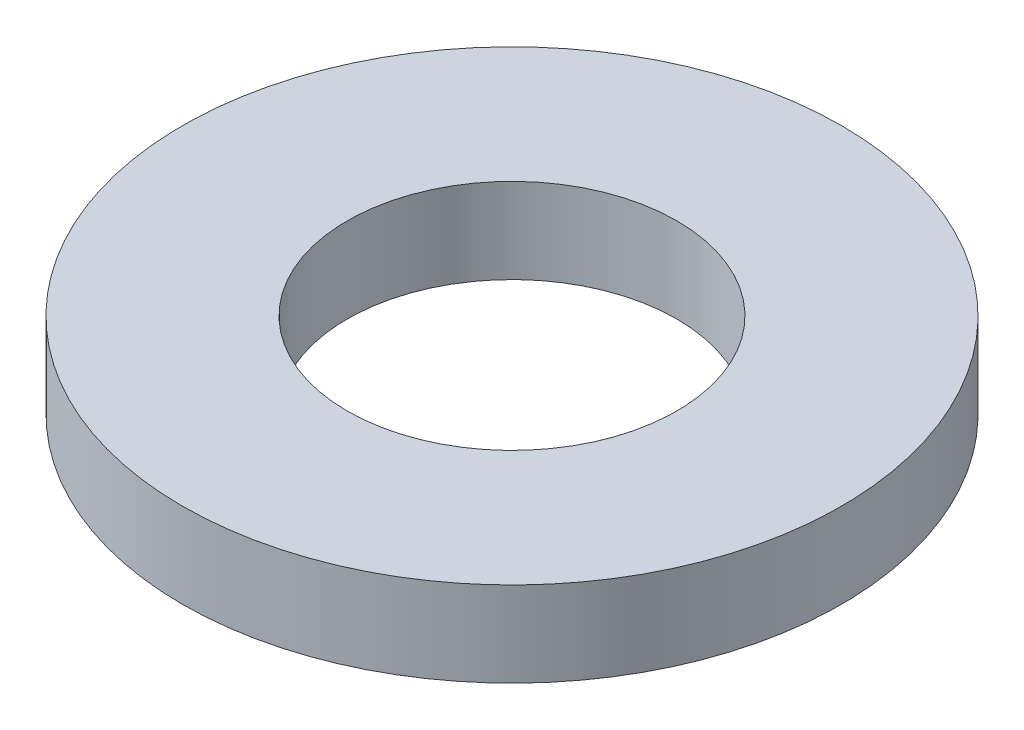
ISO-10303-21;
HEADER;
FILE_DESCRIPTION(('STEP AP214'),'2;1');
FILE_NAME('part.step','',(''),(''),'','','');
FILE_SCHEMA(('AUTOMOTIVE_DESIGN { 1 0 10303 214 1 1 1 1 }'));
ENDSEC;
DATA;
#1=APPLICATION_CONTEXT('core data for automotive mechanical design processes');
#2=APPLICATION_PROTOCOL_DEFINITION('international standard','automotive_design',2000,#1);
#3=PRODUCT_CONTEXT('',#1,'mechanical');
#4=PRODUCT('Part','Part','',(#3));
#5=PRODUCT_RELATED_PRODUCT_CATEGORY('part','',(#4));
#6=PRODUCT_DEFINITION_FORMATION('','',#4);
#7=PRODUCT_DEFINITION_CONTEXT('part definition',#1,'design');
#8=PRODUCT_DEFINITION('design','',#6,#7);
#9=PRODUCT_DEFINITION_SHAPE('','',#8);
#10=(LENGTH_UNIT() NAMED_UNIT(*) SI_UNIT(.MILLI.,.METRE.));
#11=(NAMED_UNIT(*) PLANE_ANGLE_UNIT() SI_UNIT($,.RADIAN.));
#12=(NAMED_UNIT(*) SI_UNIT($,.STERADIAN.) SOLID_ANGLE_UNIT());
#13=UNCERTAINTY_MEASURE_WITH_UNIT(LENGTH_MEASURE(1.E-05),#10,'distance_accuracy_value','');
#14=(GEOMETRIC_REPRESENTATION_CONTEXT(3) GLOBAL_UNCERTAINTY_ASSIGNED_CONTEXT((#13)) GLOBAL_UNIT_ASSIGNED_CONTEXT((#10,
#11,#12)) REPRESENTATION_CONTEXT('',''));
#15=CARTESIAN_POINT('',(0.,0.,0.));
#16=DIRECTION('',(0.,0.,1.));
#17=DIRECTION('',(1.,0.,0.));
#18=AXIS2_PLACEMENT_3D('',#15,#16,#17);
#19=CARTESIAN_POINT('',(0.,0.8,0.));
#20=DIRECTION('',(0.,1.,0.));
#21=DIRECTION('',(0.,0.,1.));
#22=AXIS2_PLACEMENT_3D('',#19,#20,#21);
#23=PLANE('',#22);
#24=CARTESIAN_POINT('',(0.,0.8,0.));
#25=DIRECTION('',(0.,1.,0.));
#26=DIRECTION('',(0.,0.,1.));
#27=AXIS2_PLACEMENT_3D('',#24,#25,#26);
#28=CIRCLE('',#27,1.55);
#29=CARTESIAN_POINT('',(0.,0.8,1.55));
#30=VERTEX_POINT('',#29);
#31=EDGE_CURVE('E26',#30,#30,#28,.F.);
#32=ORIENTED_EDGE('',*,*,#31,.T.);
#33=EDGE_LOOP('',(#32));
#34=FACE_BOUND('',#33,.T.);
#35=CARTESIAN_POINT('',(0.,0.8,0.));
#36=DIRECTION('',(0.,1.,0.));
#37=DIRECTION('',(0.,0.,1.));
#38=AXIS2_PLACEMENT_3D('',#35,#36,#37);
#39=CIRCLE('',#38,3.1);
#40=CARTESIAN_POINT('',(0.,0.8,3.1));
#41=VERTEX_POINT('',#40);
#42=EDGE_CURVE('E17',#41,#41,#39,.F.);
#43=ORIENTED_EDGE('',*,*,#42,.F.);
#44=EDGE_LOOP('',(#43));
#45=FACE_BOUND('',#44,.T.);
#46=ADVANCED_FACE('F14',(#34,#45),#23,.T.);
#47=CARTESIAN_POINT('',(0.,0.,0.));
#48=DIRECTION('',(0.,1.,0.));
#49=DIRECTION('',(0.,0.,1.));
#50=AXIS2_PLACEMENT_3D('',#47,#48,#49);
#51=CYLINDRICAL_SURFACE('',#50,3.1);
#52=ORIENTED_EDGE('',*,*,#42,.T.);
#53=EDGE_LOOP('',(#52));
#54=FACE_BOUND('',#53,.T.);
#55=CARTESIAN_POINT('',(0.,0.,0.));
#56=DIRECTION('',(0.,1.,0.));
#57=DIRECTION('',(0.,0.,1.));
#58=AXIS2_PLACEMENT_3D('',#55,#56,#57);
#59=CIRCLE('',#58,3.1);
#60=CARTESIAN_POINT('',(0.,0.,3.1));
#61=VERTEX_POINT('',#60);
#62=EDGE_CURVE('E21',#61,#61,#59,.T.);
#63=ORIENTED_EDGE('',*,*,#62,.T.);
#64=EDGE_LOOP('',(#63));
#65=FACE_BOUND('',#64,.T.);
#66=ADVANCED_FACE('F34',(#54,#65),#51,.T.);
#67=CARTESIAN_POINT('',(0.,0.,0.));
#68=DIRECTION('',(0.,1.,0.));
#69=DIRECTION('',(0.,0.,1.));
#70=AXIS2_PLACEMENT_3D('',#67,#68,#69);
#71=CYLINDRICAL_SURFACE('',#70,1.55);
#72=ORIENTED_EDGE('',*,*,#31,.F.);
#73=EDGE_LOOP('',(#72));
#74=FACE_BOUND('',#73,.T.);
#75=CARTESIAN_POINT('',(0.,0.,0.));
#76=DIRECTION('',(0.,1.,0.));
#77=DIRECTION('',(0.,0.,1.));
#78=AXIS2_PLACEMENT_3D('',#75,#76,#77);
#79=CIRCLE('',#78,1.55);
#80=CARTESIAN_POINT('',(0.,0.,1.55));
#81=VERTEX_POINT('',#80);
#82=EDGE_CURVE('E10',#81,#81,#79,.F.);
#83=ORIENTED_EDGE('',*,*,#82,.T.);
#84=EDGE_LOOP('',(#83));
#85=FACE_BOUND('',#84,.T.);
#86=ADVANCED_FACE('F42',(#74,#85),#71,.F.);
#87=CARTESIAN_POINT('',(0.,0.,0.));
#88=DIRECTION('',(0.,1.,0.));
#89=DIRECTION('',(0.,0.,1.));
#90=AXIS2_PLACEMENT_3D('',#87,#88,#89);
#91=PLANE('',#90);
#92=ORIENTED_EDGE('',*,*,#82,.F.);
#93=EDGE_LOOP('',(#92));
#94=FACE_BOUND('',#93,.T.);
#95=ORIENTED_EDGE('',*,*,#62,.F.);
#96=EDGE_LOOP('',(#95));
#97=FACE_BOUND('',#96,.T.);
#98=ADVANCED_FACE('F43',(#94,#97),#91,.F.);
#99=CLOSED_SHELL('',(#46,#66,#86,#98));
#100=MANIFOLD_SOLID_BREP('B1',#99);
#101=ADVANCED_BREP_SHAPE_REPRESENTATION('',(#18,#100),#14);
#102=SHAPE_DEFINITION_REPRESENTATION(#9,#101);
ENDSEC;
END-ISO-10303-21;
